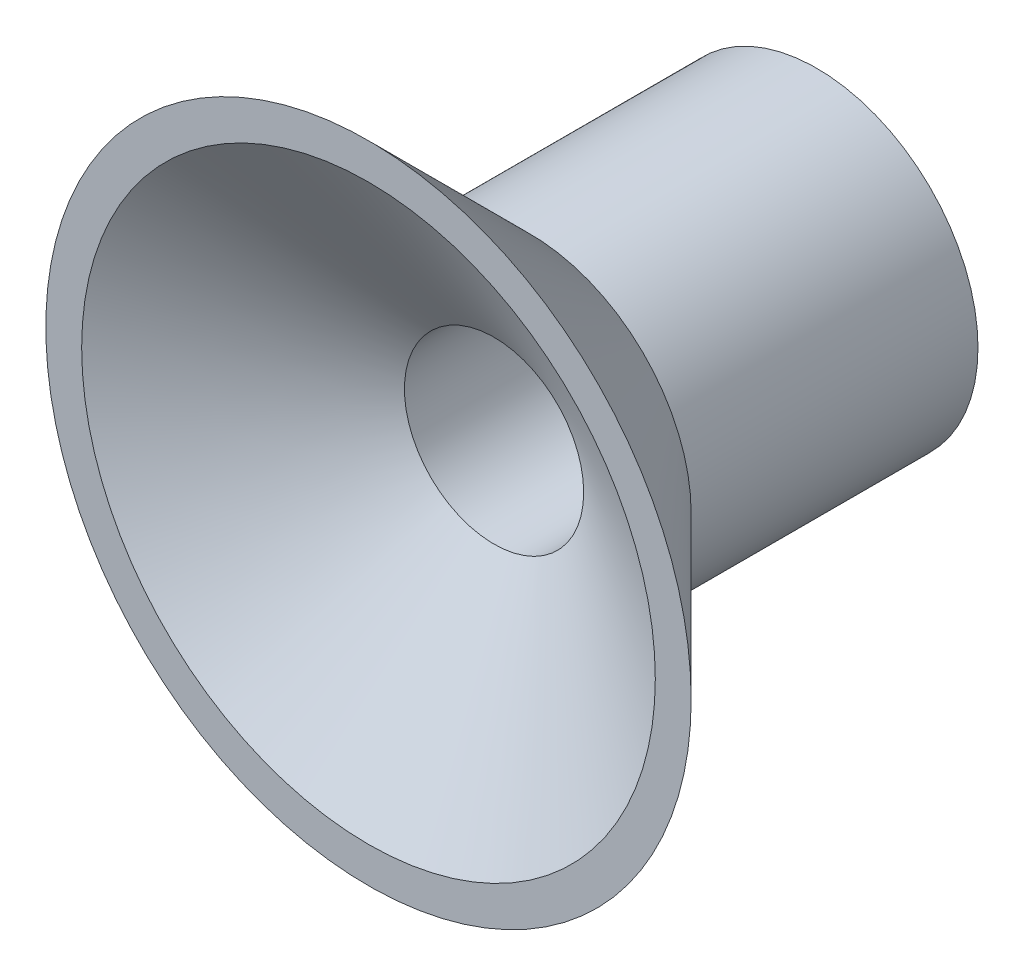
from build123d import *


with BuildPart() as part:
    # Sketch 1 → Revolve 1 (revolve)
    with BuildSketch(Plane(origin=(0, 0, 0), x_dir=(1, 0, 0), z_dir=(0, 1, 0)), mode=Mode.PRIVATE) as revolve_1_sk:
        Polygon((-2.5, 12.5), (-2.5, 3.502347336), (-8, 0), (-9, 0), (-4.5, 4.5), (-4.5, 12.5), align=None)
    revolve(revolve_1_sk.sketch.rotate(Axis((0, 0, 0), (0, 0, -1)), 180), axis=Axis((0, 0, 0), (0, 0, -1)))


solid = part.part
